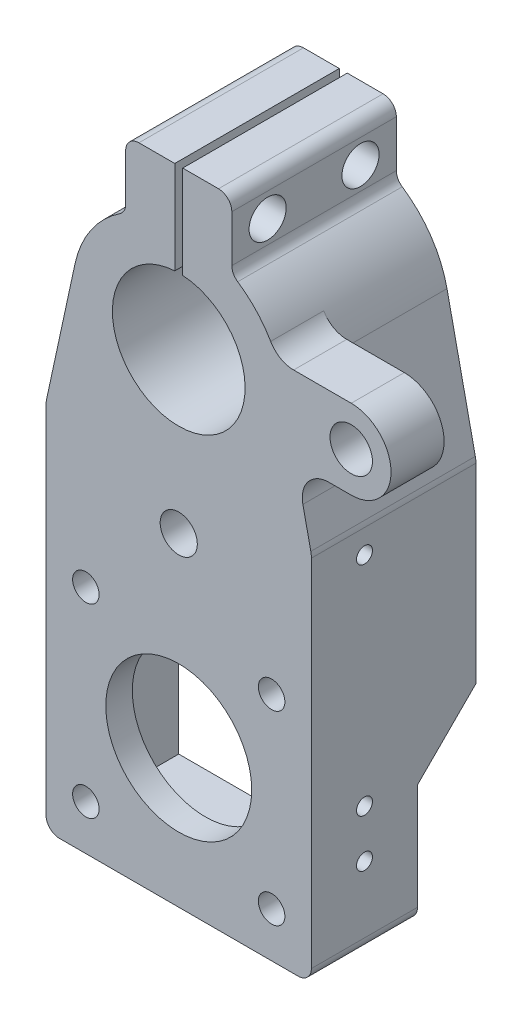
from build123d import *
from build123d.topology import SkipClean

# Parameters (mm, degrees)
SKETCH_1_R          = 25
SKETCH_1_R_2        = 27.5
SKETCH_1_R_3        = 8
SKETCH_1_R_4        = 5
EXTRUDE_1_DEPTH     = 20
EXTRUDE_START       = 42
SKETCH_2_R          = 25
SKETCH_2_R_2        = 5
SKETCH_2_R_3        = 27.5
SKETCH_2_R_4        = 7
EXTRUDE_2_DEPTH     = 42
SKETCH_3_R          = 7
CUT_EXTRUDE_1_DEPTH = 216.276566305
CUT_EXTRUDE_2_DEPTH = 52
SKETCH_5_W          = 3
SKETCH_5_H          = 98.213083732
CUT_EXTRUDE_3_DEPTH = 41
SKETCH_6_R          = 7
CUT_EXTRUDE_4_DEPTH = 10
CUT_EXTRUDE_5_REACH = 208.795
SKETCH_7_R          = 4.5
CUT_EXTRUDE_7_DEPTH = 100
SKETCH_9_R          = 3
CUT_EXTRUDE_8_DEPTH = 10
SKETCH_10_R         = 2.5
CUT_EXTRUDE_9_DEPTH = 10


with BuildPart() as part:
    # Sketch 1 → Extrude 1 (new body)
    with BuildSketch(Plane.XY):
        with BuildLine():
            Line((50, 86.931783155), (50, -47))
            ThreePointArc((50, -47), (48.535533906, -50.535533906), (45, -52))
            Line((45, -52), (-45, -52))
            ThreePointArc((-45, -52), (-48.535533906, -50.535533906), (-50, -47))
            Line((-50, -47), (-50, 86.931783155))
            ThreePointArc((-50, 86.931783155), (-49.943429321, 87.993957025), (-49.774357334, 89.044113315))
            Line((-49.774357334, 89.044113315), (-39.097429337, 138.449320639))
            ThreePointArc((-39.097429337, 138.449320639), (-33.074267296, 152.496507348), (-22.222222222, 163.259176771))
            ThreePointArc((-22.222222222, 163.259176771), (-20.590414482, 165.059551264), (-20, 167.416573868))
            Line((-20, 167.416573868), (-20, 185))
            ThreePointArc((-20, 185), (-18.535533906, 188.535533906), (-15, 190))
            Line((-15, 190), (0, 190))
            Line((0, 190), (15, 190))
            ThreePointArc((15, 190), (18.535533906, 188.535533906), (20, 185))
            Line((20, 185), (20, 167.416573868))
            ThreePointArc((20, 167.416573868), (20.590414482, 165.059551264), (22.222222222, 163.259176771))
            ThreePointArc((22.222222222, 163.259176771), (29.194321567, 157.343949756), (34.641016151, 150))
            ThreePointArc((34.641016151, 150), (38.301270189, 146.339745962), (43.301270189, 145))
            Line((43.301270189, 145), (65, 145))
            ThreePointArc((65, 145), (80, 130), (65, 115))
            Line((65, 115), (56.556992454, 115))
            ThreePointArc((56.556992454, 115), (48.774855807, 111.279995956), (46.78263512, 102.88766984))
            Line((46.78263512, 102.88766984), (49.774357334, 89.044113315))
            ThreePointArc((49.774357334, 89.044113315), (49.943429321, 87.993957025), (50, 86.931783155))
        make_face()
        with Locations((0, 130)):
            Circle(SKETCH_1_R, mode=Mode.SUBTRACT)
        Circle(SKETCH_1_R_2, mode=Mode.SUBTRACT)
        with Locations((65, 130)):
            Circle(SKETCH_1_R_3, mode=Mode.SUBTRACT)
        with Locations((-35, -35)):
            Circle(SKETCH_1_R_4, mode=Mode.SUBTRACT)
        with Locations(Location((-35, 35, 0), (0, 0, 180))):
            Circle(SKETCH_1_R_4, mode=Mode.SUBTRACT)
        with Locations(Location((35, -35, 0), (0, 0, 180))):
            Circle(SKETCH_1_R_4, mode=Mode.SUBTRACT)
        with Locations((35, 35)):
            Circle(SKETCH_1_R_4, mode=Mode.SUBTRACT)
    extrude(amount=EXTRUDE_1_DEPTH)

    # Sketch 2 → Extrude 2 (add)
    with SkipClean():  # the faces are left unmerged after this step: merging them gives an invalid solid
        with BuildSketch(Plane(origin=(0, 0, 0), x_dir=(-1, 0, 0), z_dir=(0, 0, -1)).offset(EXTRUDE_START)):
            with BuildLine():
                Line((-20, 167.416573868), (-20, 185))
                ThreePointArc((-20, 185), (-18.535533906, 188.535533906), (-15, 190))
                Line((-15, 190), (15, 190))
                ThreePointArc((15, 190), (18.535533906, 188.535533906), (20, 185))
                Line((20, 185), (20, 167.416573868))
                ThreePointArc((20, 167.416573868), (20.590414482, 165.059551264), (22.222222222, 163.259176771))
                ThreePointArc((22.222222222, 163.259176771), (33.074267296, 152.496507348), (39.097429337, 138.449320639))
                Line((39.097429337, 138.449320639), (49.774357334, 89.044113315))
                ThreePointArc((49.774357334, 89.044113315), (49.943429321, 87.993957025), (50, 86.931783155))
                Line((50, 86.931783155), (50, -47))
                ThreePointArc((50, -47), (48.535533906, -50.535533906), (45, -52))
                Line((45, -52), (-45, -52))
                ThreePointArc((-45, -52), (-48.535533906, -50.535533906), (-50, -47))
                Line((-50, -47), (-50, 86.931783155))
                ThreePointArc((-50, 86.931783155), (-49.943429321, 87.993957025), (-49.774357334, 89.044113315))
                Line((-49.774357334, 89.044113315), (-39.097429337, 138.449320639))
                ThreePointArc((-39.097429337, 138.449320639), (-33.074267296, 152.496507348), (-22.222222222, 163.259176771))
                ThreePointArc((-22.222222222, 163.259176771), (-20.590414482, 165.059551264), (-20, 167.416573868))
            make_face()
            with Locations((0, 130)):
                Circle(SKETCH_2_R, mode=Mode.SUBTRACT)
            with Locations((-35, 35)):
                Circle(SKETCH_2_R_2, mode=Mode.SUBTRACT)
            with Locations((35, 35)):
                Circle(SKETCH_2_R_2, mode=Mode.SUBTRACT)
            with Locations((35, -35)):
                Circle(SKETCH_2_R_2, mode=Mode.SUBTRACT)
            Circle(SKETCH_2_R_3, mode=Mode.SUBTRACT)
            with Locations((-35, -35)):
                Circle(SKETCH_2_R_2, mode=Mode.SUBTRACT)
            with Locations(Location((0, 70, 0), (0, 0, 180))):
                Circle(SKETCH_2_R_4, mode=Mode.SUBTRACT)
        extrude(amount=-EXTRUDE_2_DEPTH)

    # Sketch 3 → Cut-Extrude 1 (cut, through all)
    with BuildSketch(Plane(origin=(0, 0, -42), x_dir=(-1, 0, 0), z_dir=(0, 0, -1))):
        with Locations(Location((0, 70, 0), (0, 0, 180))):
            Circle(SKETCH_3_R)
    extrude(amount=-CUT_EXTRUDE_1_DEPTH, mode=Mode.SUBTRACT)

    # Sketch 4 → Cut-Extrude 2 (cut)
    with SkipClean():  # the faces are left unmerged after this step: merging them gives an invalid solid
        with BuildSketch(Plane(origin=(0, 0, -42), x_dir=(-1, 0, 0), z_dir=(0, 0, -1))):
            with BuildLine():
                Line((40, 81.010205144), (40, -42))
                Line((40, -42), (-40, -42))
                Line((-40, -42), (-40, 81.010205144))
                ThreePointArc((-40, 81.010205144), (-32.833494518, 93.802248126), (-18.181818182, 94.371058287))
                ThreePointArc((-18.181818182, 94.371058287), (0, 90), (18.181818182, 94.371058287))
                ThreePointArc((18.181818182, 94.371058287), (32.833494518, 93.802248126), (40, 81.010205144))
            make_face()
        extrude(amount=-CUT_EXTRUDE_2_DEPTH, mode=Mode.SUBTRACT)

    # Sketch 5 → Cut-Extrude 3 (cut)
    with BuildSketch(Plane(origin=(0, 190, 0), x_dir=(1, 0, 0), z_dir=(0, 1, 0))):
        Rectangle(SKETCH_5_W, SKETCH_5_H)
    extrude(amount=-CUT_EXTRUDE_3_DEPTH, mode=Mode.SUBTRACT)

    # Sketch 6 → Cut-Extrude 4 (cut)
    with BuildSketch(Plane(origin=(20, 0, 0), x_dir=(0, 0, -1), z_dir=(1, 0, 0))):
        with Locations(Location((-6.5, 176, 0), (0, 0, 90))):
            Circle(SKETCH_6_R)
        with Locations(Location((28.5, 176, 0), (0, 0, 90))):
            Circle(SKETCH_6_R)
    extrude(amount=-CUT_EXTRUDE_4_DEPTH, mode=Mode.SUBTRACT)

    # Cut-Extrude 5: up to this face of the body (flat: up to its plane)
    cut_extrude_5_end = Plane(part.part.faces().sort_by_distance((-20, 176.208286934, -11))[0])
    # Sketch 7 → Cut-Extrude 5 (cut, up to the picked face)
    with BuildSketch(Plane(origin=(10, 0, 0), x_dir=(0, 0, -1), z_dir=(1, 0, 0)), mode=Mode.PRIVATE) as cut_extrude_5_sk1:
        with Locations(Location((-6.5, 176, 0), (0, 0, 90))):
            Circle(SKETCH_7_R)
    cut_extrude_5_tool1 = split(extrude(cut_extrude_5_sk1.sketch, amount=-CUT_EXTRUDE_5_REACH, mode=Mode.PRIVATE), bisect_by=cut_extrude_5_end, keep=Keep.BOTH, mode=Mode.PRIVATE)
    # Sketch 7 → Cut-Extrude 5 (cut, up to the picked face)
    with BuildSketch(Plane(origin=(10, 0, 0), x_dir=(0, 0, -1), z_dir=(1, 0, 0)), mode=Mode.PRIVATE) as cut_extrude_5_sk2:
        with Locations(Location((28.5, 176, 0), (0, 0, 90))):
            Circle(SKETCH_7_R)
    cut_extrude_5_tool2 = split(extrude(cut_extrude_5_sk2.sketch, amount=-CUT_EXTRUDE_5_REACH, mode=Mode.PRIVATE), bisect_by=cut_extrude_5_end, keep=Keep.BOTH, mode=Mode.PRIVATE)
    add(cut_extrude_5_tool1.solids().sort_by(Axis((10, 176, 6.5), (-1, 0, 0)))[0], mode=Mode.SUBTRACT)
    add(cut_extrude_5_tool2.solids().sort_by(Axis((10, 176, -28.5), (-1, 0, 0)))[0], mode=Mode.SUBTRACT)

    # Sketch 8 → Cut-Extrude 7 (cut)
    with BuildSketch(Plane(origin=(50, 0, 0), x_dir=(0, 0, -1), z_dir=(1, 0, 0))):
        Polygon((20, -52), (42, -52), (42, 15), (20, -7), align=None)
    extrude(amount=-CUT_EXTRUDE_7_DEPTH, mode=Mode.SUBTRACT)

    # Sketch 9 → Cut-Extrude 8 (cut)
    with BuildSketch(Plane(origin=(50, 0, 0), x_dir=(0, 0, -1), z_dir=(1, 0, 0))):
        with Locations(Location((0, -22, 0), (0, 0, 90))):
            Circle(SKETCH_9_R)
        with Locations(Location((0, -4, 0), (0, 0, 90))):
            Circle(SKETCH_9_R)
        with Locations(Location((0, 78, 0), (0, 0, 90))):
            Circle(SKETCH_9_R)
    extrude(amount=-CUT_EXTRUDE_8_DEPTH, mode=Mode.SUBTRACT)

    # Sketch 10 → Cut-Extrude 9 (cut)
    with BuildSketch(Plane(origin=(-65.938100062, 14.249840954, 0), x_dir=(0, 0, 1), z_dir=(-0.9774357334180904, 0.21123301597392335, 0))):
        with Locations(Location((-10, 108.066645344, 0), (0, 0, 270))):
            Circle(SKETCH_10_R)
        with Locations(Location((-10, 96.066645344, 0), (0, 0, 270))):
            Circle(SKETCH_10_R)
    extrude(amount=-CUT_EXTRUDE_9_DEPTH, mode=Mode.SUBTRACT)


solid = part.part
